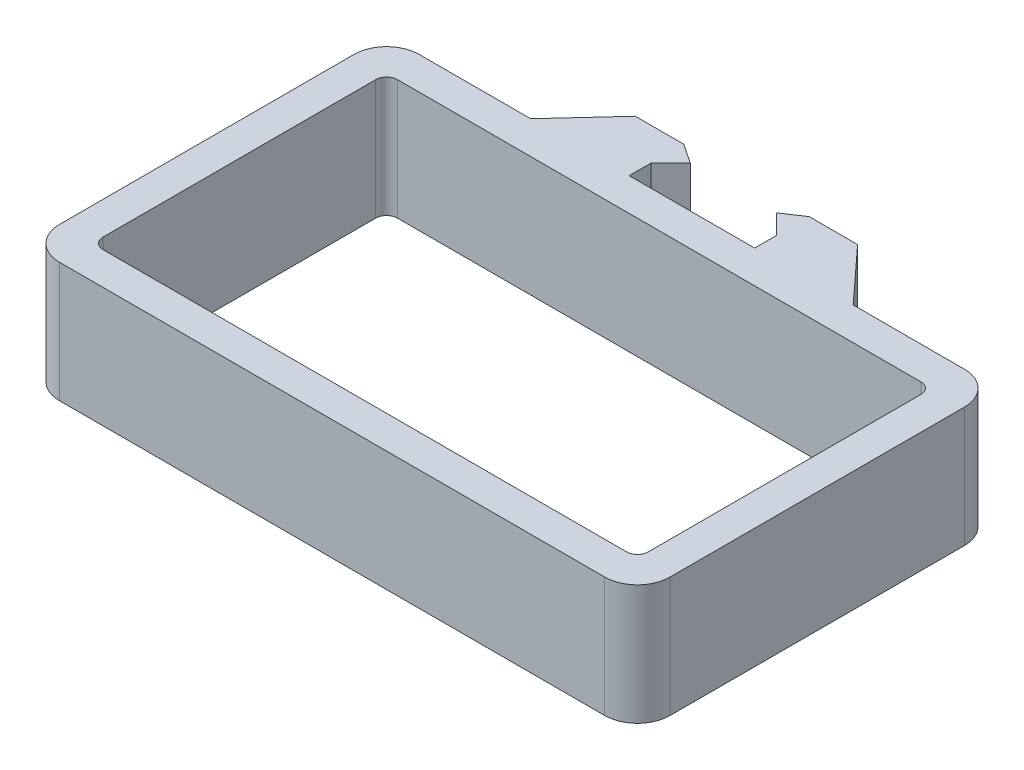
from build123d import *

# Parameters (mm, degrees)
BOSS_EXTRUDE1_DEPTH = 11


with BuildPart() as part:
    # Sketch1 → Boss-Extrude1 (new body)
    # profile 1 of 3: a face of its own
    with BuildSketch(Plane(origin=(0, 0, 0), x_dir=(1, 0, 0), z_dir=(0, 1, 0))):
        with BuildLine():
            ThreePointArc((25, 16.5), (27.121320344, 15.621320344), (28, 13.5))
            Line((28, 13.5), (28, -13.5))
            ThreePointArc((28, -13.5), (27.121320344, -15.621320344), (25, -16.5))
            Line((25, -16.5), (-25, -16.5))
            ThreePointArc((-25, -16.5), (-27.121320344, -15.621320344), (-28, -13.5))
            Line((-28, -13.5), (-28, 13.5))
            ThreePointArc((-28, 13.5), (-27.121320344, 15.621320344), (-25, 16.5))
            Line((-25, 16.5), (25, 16.5))
        make_face()
        with BuildLine():
            Line((-24, 13.5), (24, 13.5))
            ThreePointArc((24, 13.5), (24.707106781, 13.207106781), (25, 12.5))
            Line((25, 12.5), (25, -12.5))
            ThreePointArc((25, -12.5), (24.707106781, -13.207106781), (24, -13.5))
            Line((24, -13.5), (-24, -13.5))
            ThreePointArc((-24, -13.5), (-24.707106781, -13.207106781), (-25, -12.5))
            Line((-25, -12.5), (-25, 12.5))
            ThreePointArc((-25, 12.5), (-24.707106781, 13.207106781), (-24, 13.5))
        make_face(mode=Mode.SUBTRACT)
    # profile 2 of 3: a face of its own
    with BuildSketch(Plane(origin=(0, 0, 0), x_dir=(1, 0, 0), z_dir=(0, 1, 0))):
        Polygon((-10.191136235, 21.5), (-14.792473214, 16.5), (-5.75, 16.5), (-5.75, 18.5), (-3.95, 20.3), (-5.75, 21.5), align=None)
    # profile 3 of 3: a face of its own
    with BuildSketch(Plane(origin=(0, 0, 0), x_dir=(1, 0, 0), z_dir=(0, 1, 0))):
        Polygon((5.75, 18.5), (5.75, 16.5), (14.792473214, 16.5), (10.191136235, 21.5), (5.75, 21.5), (3.95, 20.3), align=None)
    extrude(amount=BOSS_EXTRUDE1_DEPTH)


solid = part.part
